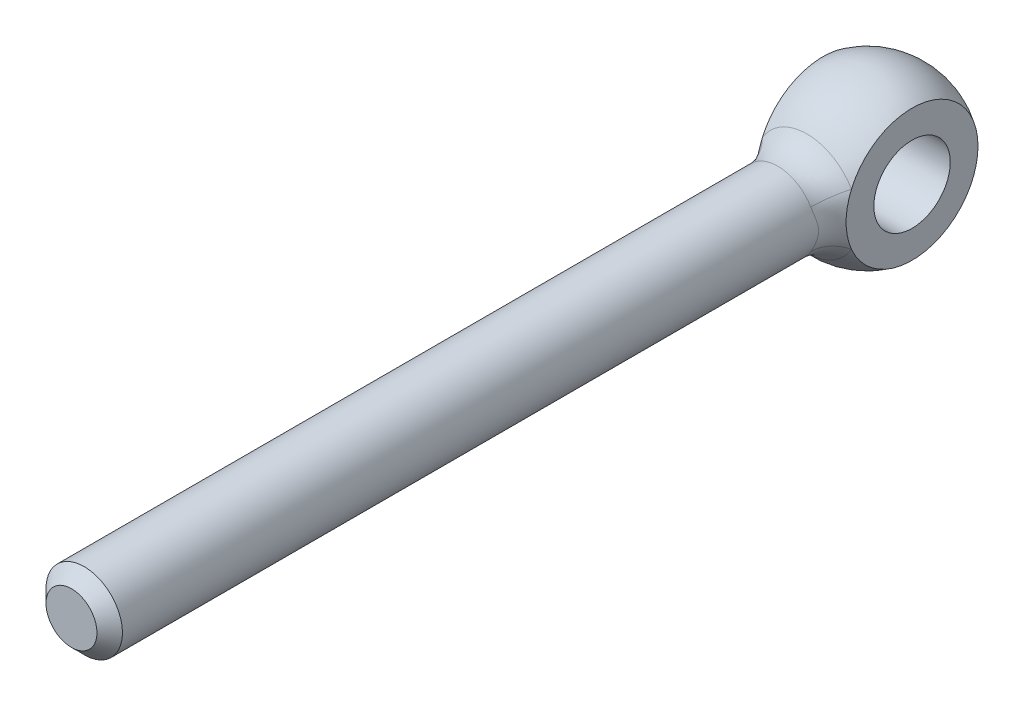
ISO-10303-21;
HEADER;
FILE_DESCRIPTION(('STEP AP214'),'2;1');
FILE_NAME('part.step','',(''),(''),'','','');
FILE_SCHEMA(('AUTOMOTIVE_DESIGN { 1 0 10303 214 1 1 1 1 }'));
ENDSEC;
DATA;
#1=APPLICATION_CONTEXT('core data for automotive mechanical design processes');
#2=APPLICATION_PROTOCOL_DEFINITION('international standard','automotive_design',2000,#1);
#3=PRODUCT_CONTEXT('',#1,'mechanical');
#4=PRODUCT('Part','Part','',(#3));
#5=PRODUCT_RELATED_PRODUCT_CATEGORY('part','',(#4));
#6=PRODUCT_DEFINITION_FORMATION('','',#4);
#7=PRODUCT_DEFINITION_CONTEXT('part definition',#1,'design');
#8=PRODUCT_DEFINITION('design','',#6,#7);
#9=PRODUCT_DEFINITION_SHAPE('','',#8);
#10=(LENGTH_UNIT() NAMED_UNIT(*) SI_UNIT(.MILLI.,.METRE.));
#11=(NAMED_UNIT(*) PLANE_ANGLE_UNIT() SI_UNIT($,.RADIAN.));
#12=(NAMED_UNIT(*) SI_UNIT($,.STERADIAN.) SOLID_ANGLE_UNIT());
#13=UNCERTAINTY_MEASURE_WITH_UNIT(LENGTH_MEASURE(1.E-05),#10,'distance_accuracy_value','');
#14=(GEOMETRIC_REPRESENTATION_CONTEXT(3) GLOBAL_UNCERTAINTY_ASSIGNED_CONTEXT((#13)) GLOBAL_UNIT_ASSIGNED_CONTEXT((#10,
#11,#12)) REPRESENTATION_CONTEXT('',''));
#15=CARTESIAN_POINT('',(0.,0.,0.));
#16=DIRECTION('',(0.,0.,1.));
#17=DIRECTION('',(1.,0.,0.));
#18=AXIS2_PLACEMENT_3D('',#15,#16,#17);
#19=CARTESIAN_POINT('',(0.,0.,0.));
#20=DIRECTION('',(1.,0.,0.));
#21=DIRECTION('',(0.,0.,-1.));
#22=AXIS2_PLACEMENT_3D('',#19,#20,#21);
#23=SPHERICAL_SURFACE('',#22,12.5);
#24=CARTESIAN_POINT('',(-7.,0.,0.));
#25=DIRECTION('',(-1.,0.,0.));
#26=DIRECTION('',(0.,0.,1.));
#27=AXIS2_PLACEMENT_3D('',#24,#25,#26);
#28=CIRCLE('',#27,10.356157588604);
#29=CARTESIAN_POINT('',(-7.,-4.09162768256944,9.51359989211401));
#30=VERTEX_POINT('',#29);
#31=CARTESIAN_POINT('',(-7.,4.09162768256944,9.51359989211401));
#32=VERTEX_POINT('',#31);
#33=EDGE_CURVE('E65',#30,#32,#28,.F.);
#34=ORIENTED_EDGE('',*,*,#33,.T.);
#35=CARTESIAN_POINT('',(0.,0.,9.51359989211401));
#36=DIRECTION('',(0.,0.,-1.));
#37=DIRECTION('',(-1.,0.,0.));
#38=AXIS2_PLACEMENT_3D('',#35,#36,#37);
#39=CIRCLE('',#38,8.10810810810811);
#40=CARTESIAN_POINT('',(7.,4.09162768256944,9.51359989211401));
#41=VERTEX_POINT('',#40);
#42=EDGE_CURVE('E73',#32,#41,#39,.T.);
#43=ORIENTED_EDGE('',*,*,#42,.T.);
#44=CARTESIAN_POINT('',(7.,0.,0.));
#45=DIRECTION('',(-1.,0.,0.));
#46=DIRECTION('',(0.,0.,1.));
#47=AXIS2_PLACEMENT_3D('',#44,#45,#46);
#48=CIRCLE('',#47,10.356157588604);
#49=CARTESIAN_POINT('',(7.,-4.09162768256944,9.51359989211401));
#50=VERTEX_POINT('',#49);
#51=EDGE_CURVE('E61',#50,#41,#48,.F.);
#52=ORIENTED_EDGE('',*,*,#51,.F.);
#53=CARTESIAN_POINT('',(0.,0.,9.51359989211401));
#54=DIRECTION('',(0.,0.,-1.));
#55=DIRECTION('',(-1.,0.,0.));
#56=AXIS2_PLACEMENT_3D('',#53,#54,#55);
#57=CIRCLE('',#56,8.10810810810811);
#58=EDGE_CURVE('E70',#50,#30,#57,.T.);
#59=ORIENTED_EDGE('',*,*,#58,.T.);
#60=EDGE_LOOP('',(#34,#43,#52,#59));
#61=FACE_BOUND('',#60,.T.);
#62=ADVANCED_FACE('F14',(#61),#23,.T.);
#63=CARTESIAN_POINT('',(0.,0.,-10.));
#64=DIRECTION('',(0.,0.,-1.));
#65=DIRECTION('',(-1.,0.,0.));
#66=AXIS2_PLACEMENT_3D('',#63,#64,#65);
#67=CYLINDRICAL_SURFACE('',#66,6.);
#68=CARTESIAN_POINT('',(-7.,-5.52065402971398,8.76198488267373));
#69=CARTESIAN_POINT('',(-4.73347626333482,-3.77093453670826,10.4723797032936));
#70=CARTESIAN_POINT('',(-4.16393928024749,-4.31990852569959,13.7124960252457));
#71=CARTESIAN_POINT('',(-7.,-5.43196771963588,8.81784503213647));
#72=CARTESIAN_POINT('',(-4.75237008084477,-3.73175735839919,10.5424849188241));
#73=CARTESIAN_POINT('',(-4.24629318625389,-4.24055975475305,13.7683625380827));
#74=CARTESIAN_POINT('',(-7.,-5.34113251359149,8.87321411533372));
#75=CARTESIAN_POINT('',(-4.77436164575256,-3.69082707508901,10.6107881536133));
#76=CARTESIAN_POINT('',(-4.32694937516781,-4.15824402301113,13.8171854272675));
#77=CARTESIAN_POINT('',(-7.,-5.15454022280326,8.98290118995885));
#78=CARTESIAN_POINT('',(-4.82415359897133,-3.60403478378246,10.7430059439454));
#79=CARTESIAN_POINT('',(-4.48416075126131,-3.98818699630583,13.901592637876));
#80=CARTESIAN_POINT('',(-7.,-5.05878355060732,9.03721926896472));
#81=CARTESIAN_POINT('',(-4.85191265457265,-3.55821882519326,10.8069099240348));
#82=CARTESIAN_POINT('',(-4.56071628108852,-3.900446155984,13.9371780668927));
#83=CARTESIAN_POINT('',(-7.,-4.86225075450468,9.14444949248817));
#84=CARTESIAN_POINT('',(-4.91269251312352,-3.4604371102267,10.9295511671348));
#85=CARTESIAN_POINT('',(-4.70862752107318,-3.72052921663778,13.9958066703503));
#86=CARTESIAN_POINT('',(-7.,-4.76150508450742,9.19736771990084));
#87=CARTESIAN_POINT('',(-4.94564175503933,-3.40856162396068,10.9883134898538));
#88=CARTESIAN_POINT('',(-4.78000947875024,-3.62838012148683,14.0189176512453));
#89=CARTESIAN_POINT('',(-7.,-4.55392848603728,9.3018943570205));
#90=CARTESIAN_POINT('',(-5.0160308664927,-3.29716736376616,11.1005263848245));
#91=CARTESIAN_POINT('',(-4.91748494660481,-3.43975979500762,14.05392978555));
#92=CARTESIAN_POINT('',(-7.,-4.44710008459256,9.35350329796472));
#93=CARTESIAN_POINT('',(-5.05343304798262,-3.23771146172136,11.1539919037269));
#94=CARTESIAN_POINT('',(-4.98358062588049,-3.34329036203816,14.0658355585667));
#95=CARTESIAN_POINT('',(-7.,-4.29695862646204,9.42274283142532));
#96=CARTESIAN_POINT('',(-5.10676472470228,-3.15059746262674,11.2230561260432));
#97=CARTESIAN_POINT('',(-5.06977684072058,-3.20923152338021,14.0752452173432));
#98=CARTESIAN_POINT('',(-7.,-4.25653508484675,9.44107582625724));
#99=CARTESIAN_POINT('',(-5.12115703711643,-3.12687435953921,11.2410365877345));
#100=CARTESIAN_POINT('',(-5.09235610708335,-3.17328084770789,14.0770920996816));
#101=CARTESIAN_POINT('',(-7.,-4.17477524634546,9.47751307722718));
#102=CARTESIAN_POINT('',(-5.15031007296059,-3.07824781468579,11.2762248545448));
#103=CARTESIAN_POINT('',(-5.13675282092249,-3.10089882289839,14.0795339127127));
#104=CARTESIAN_POINT('',(-7.,-4.13343888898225,9.49561731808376));
#105=CARTESIAN_POINT('',(-5.16506981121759,-3.05334717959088,11.2934339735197));
#106=CARTESIAN_POINT('',(-5.15857021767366,-3.06446744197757,14.0801287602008));
#107=CARTESIAN_POINT('',(-7.,-3.93727090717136,9.57998716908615));
#108=CARTESIAN_POINT('',(-5.2348438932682,-2.93397708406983,11.3720989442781));
#109=CARTESIAN_POINT('',(-5.2591135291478,-2.89245379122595,14.0801244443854));
#110=CARTESIAN_POINT('',(-7.,-3.77644238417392,9.64471624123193));
#111=CARTESIAN_POINT('',(-5.2919851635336,-2.83149056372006,11.4288485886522));
#112=CARTESIAN_POINT('',(-5.33294423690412,-2.75394693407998,14.0720012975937));
#113=CARTESIAN_POINT('',(-7.,-3.44057965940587,9.76957212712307));
#114=CARTESIAN_POINT('',(-5.4067438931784,-2.60847852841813,11.5309624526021));
#115=CARTESIAN_POINT('',(-5.46944812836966,-2.47178930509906,14.0431824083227));
#116=CARTESIAN_POINT('',(-7.,-3.26553398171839,9.82969514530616));
#117=CARTESIAN_POINT('',(-5.46437197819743,-2.48805001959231,11.5764173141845));
#118=CARTESIAN_POINT('',(-5.53211216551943,-2.32813443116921,14.0224764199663));
#119=CARTESIAN_POINT('',(-7.,-2.89956860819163,9.94381011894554));
#120=CARTESIAN_POINT('',(-5.57626625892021,-2.22857345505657,11.6561394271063));
#121=CARTESIAN_POINT('',(-5.64613166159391,-2.03613701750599,13.9728223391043));
#122=CARTESIAN_POINT('',(-7.,-2.70859175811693,9.99777819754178));
#123=CARTESIAN_POINT('',(-5.63058064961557,-2.08950571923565,11.6904716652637));
#124=CARTESIAN_POINT('',(-5.69744376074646,-1.88777889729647,13.9438435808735));
#125=CARTESIAN_POINT('',(-7.,-2.31090588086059,10.0971127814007));
#126=CARTESIAN_POINT('',(-5.73158522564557,-1.79407236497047,11.748506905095));
#127=CARTESIAN_POINT('',(-5.78825827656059,-1.58765614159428,13.8830399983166));
#128=CARTESIAN_POINT('',(-7.,-2.10419766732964,10.142479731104));
#129=CARTESIAN_POINT('',(-5.77837504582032,-1.63766816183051,11.7723070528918));
#130=CARTESIAN_POINT('',(-5.82776130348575,-1.43589168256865,13.8512153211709));
#131=CARTESIAN_POINT('',(-7.,-1.6708535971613,10.222907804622));
#132=CARTESIAN_POINT('',(-5.86150775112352,-1.3060060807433,11.8111628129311));
#133=CARTESIAN_POINT('',(-5.8955793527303,-1.12600155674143,13.7902383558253));
#134=CARTESIAN_POINT('',(-7.,-1.44386631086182,10.257704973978));
#135=CARTESIAN_POINT('',(-5.89771030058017,-1.13021047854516,11.8260828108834));
#136=CARTESIAN_POINT('',(-5.92361308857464,-0.967810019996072,13.7611653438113));
#137=CARTESIAN_POINT('',(-7.,-0.977611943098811,10.3125756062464));
#138=CARTESIAN_POINT('',(-5.95469562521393,-0.767202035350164,11.8481867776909));
#139=CARTESIAN_POINT('',(-5.96692621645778,-0.649309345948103,13.7134560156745));
#140=CARTESIAN_POINT('',(-7.,-0.738348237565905,10.3326530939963));
#141=CARTESIAN_POINT('',(-5.97558995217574,-0.579692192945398,11.8554206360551));
#142=CARTESIAN_POINT('',(-5.98220909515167,-0.489000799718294,13.6948168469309));
#143=CARTESIAN_POINT('',(-7.,-0.254575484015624,10.3558486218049));
#144=CARTESIAN_POINT('',(-5.99967335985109,-0.200191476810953,11.8636655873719));
#145=CARTESIAN_POINT('',(-5.99980579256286,-0.167748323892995,13.6731565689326));
#146=CARTESIAN_POINT('',(-7.,-0.0100795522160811,10.3590049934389));
#147=CARTESIAN_POINT('',(-6.00295430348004,-0.0078120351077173,11.8647087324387));
#148=CARTESIAN_POINT('',(-6.00214892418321,-0.00680665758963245,13.6701001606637));
#149=CARTESIAN_POINT('',(-7.,0.476166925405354,10.3480653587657));
#150=CARTESIAN_POINT('',(-5.99159819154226,0.374022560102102,11.8609024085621));
#151=CARTESIAN_POINT('',(-5.99390260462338,0.314617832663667,13.6804268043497));
#152=CARTESIAN_POINT('',(-7.,0.717917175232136,10.3339675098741));
#153=CARTESIAN_POINT('',(-5.97693421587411,0.563895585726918,11.8560440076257));
#154=CARTESIAN_POINT('',(-5.98331177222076,0.475100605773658,13.6938116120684));
#155=CARTESIAN_POINT('',(-7.,1.17711091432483,10.2914790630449));
#156=CARTESIAN_POINT('',(-5.93280718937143,0.922682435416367,11.8398412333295));
#157=CARTESIAN_POINT('',(-5.95036755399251,0.784814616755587,13.7319958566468));
#158=CARTESIAN_POINT('',(-7.,1.39514584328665,10.2639850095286));
#159=CARTESIAN_POINT('',(-5.90419169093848,1.09249310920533,11.8288660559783));
#160=CARTESIAN_POINT('',(-5.92874844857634,0.934149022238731,13.7560718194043));
#161=CARTESIAN_POINT('',(-7.,1.81839647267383,10.1975189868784));
#162=CARTESIAN_POINT('',(-5.83527764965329,1.419266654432,11.7992510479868));
#163=CARTESIAN_POINT('',(-5.87439634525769,1.23051561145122,13.8099532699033));
#164=CARTESIAN_POINT('',(-7.,2.02361108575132,10.1585460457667));
#165=CARTESIAN_POINT('',(-5.79487748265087,1.57641327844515,11.7805559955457));
#166=CARTESIAN_POINT('',(-5.84166240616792,1.37754759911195,13.8397592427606));
#167=CARTESIAN_POINT('',(-7.,2.41979553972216,10.0715339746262));
#168=CARTESIAN_POINT('',(-5.70553324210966,1.87549175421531,11.7340817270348));
#169=CARTESIAN_POINT('',(-5.76521762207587,1.66881679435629,13.8994060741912));
#170=CARTESIAN_POINT('',(-7.,2.61075717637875,10.0234896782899));
#171=CARTESIAN_POINT('',(-5.65648641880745,2.01749587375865,11.7062202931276));
#172=CARTESIAN_POINT('',(-5.7215005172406,1.81305235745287,13.9292469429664));
#173=CARTESIAN_POINT('',(-7.,2.97823759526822,9.92051035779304));
#174=CARTESIAN_POINT('',(-5.55330052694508,2.2849738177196,11.6404397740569));
#175=CARTESIAN_POINT('',(-5.62324851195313,2.09804332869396,13.9837841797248));
#176=CARTESIAN_POINT('',(-7.,3.1547579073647,9.86557606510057));
#177=CARTESIAN_POINT('',(-5.49908883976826,2.41044201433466,11.6024299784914));
#178=CARTESIAN_POINT('',(-5.56871475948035,2.23879910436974,14.0084810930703));
#179=CARTESIAN_POINT('',(-7.,3.4776573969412,9.75613046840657));
#180=CARTESIAN_POINT('',(-5.39445517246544,2.63320590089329,11.5201628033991));
#181=CARTESIAN_POINT('',(-5.45483407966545,2.50267587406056,14.0464316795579));
#182=CARTESIAN_POINT('',(-7.,3.62530052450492,9.70209213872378));
#183=CARTESIAN_POINT('',(-5.34411434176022,2.73206566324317,11.4767663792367));
#184=CARTESIAN_POINT('',(-5.39646281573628,2.62618577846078,14.0605611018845));
#185=CARTESIAN_POINT('',(-7.,3.9101338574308,9.59083995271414));
#186=CARTESIAN_POINT('',(-5.24470174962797,2.91650977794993,11.3815427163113));
#187=CARTESIAN_POINT('',(-5.27135185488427,2.86906036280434,14.0783371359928));
#188=CARTESIAN_POINT('',(-7.,4.04732718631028,9.53362705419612));
#189=CARTESIAN_POINT('',(-5.19563379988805,3.00201545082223,11.3296558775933));
#190=CARTESIAN_POINT('',(-5.2046146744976,2.98842627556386,14.0819868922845));
#191=CARTESIAN_POINT('',(-7.,4.31290967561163,9.41647692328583));
#192=CARTESIAN_POINT('',(-5.10089049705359,3.16117080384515,11.217554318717));
#193=CARTESIAN_POINT('',(-5.0627722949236,3.22291536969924,14.0764425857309));
#194=CARTESIAN_POINT('',(-7.,4.4412469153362,9.35652657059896));
#195=CARTESIAN_POINT('',(-5.05526955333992,3.23465246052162,11.1572503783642));
#196=CARTESIAN_POINT('',(-4.98762357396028,3.33801195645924,14.0671785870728));
#197=CARTESIAN_POINT('',(-7.,4.6894021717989,9.23463387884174));
#198=CARTESIAN_POINT('',(-4.96955301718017,3.37092279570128,11.029119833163));
#199=CARTESIAN_POINT('',(-4.82981665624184,3.56255813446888,14.0336945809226));
#200=CARTESIAN_POINT('',(-7.,4.80920993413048,9.17268926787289));
#201=CARTESIAN_POINT('',(-4.92951762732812,3.43360058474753,10.9612577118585));
#202=CARTESIAN_POINT('',(-4.74714968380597,3.67200088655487,14.0094568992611));
#203=CARTESIAN_POINT('',(-7.,4.9251572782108,9.11003983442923));
#204=CARTESIAN_POINT('',(-4.8933961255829,3.49152887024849,10.8902848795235));
#205=CARTESIAN_POINT('',(-4.66109414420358,3.77812140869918,13.9767461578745));
#206=(BOUNDED_SURFACE() B_SPLINE_SURFACE(3,2,((#68,#69,#70),(#71,#72,#73),(#74,#75,#76),(#77,
#78,#79),(#80,#81,#82),(#83,#84,#85),(#86,#87,#88),(#89,#90,#91),(#92,#93,#94),(#95,#96,#97),
(#98,#99,#100),(#101,#102,#103),(#104,#105,#106),(#107,#108,#109),(#110,#111,#112),(#113,#114,
#115),(#116,#117,#118),(#119,#120,#121),(#122,#123,#124),(#125,#126,#127),(#128,#129,#130),
(#131,#132,#133),(#134,#135,#136),(#137,#138,#139),(#140,#141,#142),(#143,#144,#145),(#146,#147,
#148),(#149,#150,#151),(#152,#153,#154),(#155,#156,#157),(#158,#159,#160),(#161,#162,#163),
(#164,#165,#166),(#167,#168,#169),(#170,#171,#172),(#173,#174,#175),(#176,#177,#178),(#179,#180,
#181),(#182,#183,#184),(#185,#186,#187),(#188,#189,#190),(#191,#192,#193),(#194,#195,#196),
(#197,#198,#199),(#200,#201,#202),(#203,#204,#205)),.UNSPECIFIED.,.F.,.F.,
.F.) B_SPLINE_SURFACE_WITH_KNOTS((4,2,2,2,2,2,2,2,2,2,2,2,2,2,2,2,2,2,2,2,2,2,4),(3,3),(0.,
0.706069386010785,1.41207968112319,2.11421270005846,2.81605612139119,3.07081429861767,
3.32558940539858,4.26615695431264,5.20749141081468,6.15236157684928,7.097182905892,
8.06395765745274,9.03046796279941,9.99478789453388,10.9592108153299,11.8664791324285,
12.7738242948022,13.6816877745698,14.5894549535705,15.4094238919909,16.2291467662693,
17.0533262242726,17.8784803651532),(0.,1.),
.UNSPECIFIED.) GEOMETRIC_REPRESENTATION_ITEM() RATIONAL_B_SPLINE_SURFACE(((1.,0.874036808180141,
1.),(1.,0.875980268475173,1.),(1.,0.878049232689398,1.),(1.,0.882404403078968,1.),(1.,
0.884690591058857,1.),(1.,0.889433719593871,1.),(1.,0.891889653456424,1.),(1.,0.896934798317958,
1.),(1.,0.899523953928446,1.),(1.,0.90310513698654,1.),(1.,0.904063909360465,1.),(1.,
0.905988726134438,1.),(1.,0.906954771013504,1.),(1.,0.911497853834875,1.),(1.,0.915103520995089,
1.),(1.,0.922211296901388,1.),(1.,0.925713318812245,1.),(1.,0.932445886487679,1.),(1.,
0.93567536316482,1.),(1.,0.941657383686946,1.),(1.,0.944409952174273,1.),(1.,0.949300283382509,
1.),(1.,0.951422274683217,1.),(1.,0.954768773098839,1.),(1.,0.955993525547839,1.),(1.,
0.95740836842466,1.),(1.,0.957600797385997,1.),(1.,0.956933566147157,1.),(1.,0.956073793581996,
1.),(1.,0.953481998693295,1.),(1.,0.95180468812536,1.),(1.,0.947755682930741,1.),(1.,
0.945383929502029,1.),(1.,0.94011425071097,1.),(1.,0.937216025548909,1.),(1.,0.931066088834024,
1.),(1.,0.927814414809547,1.),(1.,0.921446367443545,1.),(1.,0.918347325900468,1.),(1.,
0.91211075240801,1.),(1.,0.908973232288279,1.),(1.,0.902748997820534,1.),(1.,0.899662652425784,
1.),(1.,0.893647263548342,1.),(1.,0.890718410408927,1.),(1.,0.887916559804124,1.))) REPRESENTATION_ITEM('') SURFACE());
#207=CARTESIAN_POINT('',(-4.66109414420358,3.77812140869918,13.9767461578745));
#208=CARTESIAN_POINT('',(-4.74714968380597,3.67200088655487,14.0094568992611));
#209=CARTESIAN_POINT('',(-4.82981665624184,3.56255813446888,14.0336945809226));
#210=CARTESIAN_POINT('',(-4.98762357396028,3.33801195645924,14.0671785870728));
#211=CARTESIAN_POINT('',(-5.0627722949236,3.22291536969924,14.0764425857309));
#212=CARTESIAN_POINT('',(-5.2046146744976,2.98842627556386,14.0819868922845));
#213=CARTESIAN_POINT('',(-5.27135185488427,2.86906036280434,14.0783371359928));
#214=CARTESIAN_POINT('',(-5.39646281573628,2.62618577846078,14.0605611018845));
#215=CARTESIAN_POINT('',(-5.45483407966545,2.50267587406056,14.0464316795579));
#216=CARTESIAN_POINT('',(-5.56871475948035,2.23879910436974,14.0084810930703));
#217=CARTESIAN_POINT('',(-5.62324851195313,2.09804332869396,13.9837841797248));
#218=CARTESIAN_POINT('',(-5.7215005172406,1.81305235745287,13.9292469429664));
#219=CARTESIAN_POINT('',(-5.76521762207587,1.66881679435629,13.8994060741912));
#220=CARTESIAN_POINT('',(-5.84166240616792,1.37754759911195,13.8397592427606));
#221=CARTESIAN_POINT('',(-5.87439634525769,1.23051561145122,13.8099532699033));
#222=CARTESIAN_POINT('',(-5.92874844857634,0.934149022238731,13.7560718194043));
#223=CARTESIAN_POINT('',(-5.95036755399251,0.784814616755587,13.7319958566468));
#224=CARTESIAN_POINT('',(-5.98331177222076,0.475100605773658,13.6938116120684));
#225=CARTESIAN_POINT('',(-5.99390260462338,0.314617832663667,13.6804268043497));
#226=CARTESIAN_POINT('',(-6.00214892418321,-0.00680665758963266,13.6701001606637));
#227=CARTESIAN_POINT('',(-5.99980579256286,-0.167748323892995,13.6731565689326));
#228=CARTESIAN_POINT('',(-5.98220909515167,-0.489000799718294,13.6948168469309));
#229=CARTESIAN_POINT('',(-5.96692621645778,-0.649309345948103,13.7134560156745));
#230=CARTESIAN_POINT('',(-5.92361308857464,-0.967810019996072,13.7611653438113));
#231=CARTESIAN_POINT('',(-5.8955793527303,-1.12600155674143,13.7902383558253));
#232=CARTESIAN_POINT('',(-5.82776130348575,-1.43589168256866,13.8512153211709));
#233=CARTESIAN_POINT('',(-5.78825827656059,-1.58765614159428,13.8830399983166));
#234=CARTESIAN_POINT('',(-5.69744376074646,-1.88777889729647,13.9438435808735));
#235=CARTESIAN_POINT('',(-5.64613166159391,-2.03613701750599,13.9728223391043));
#236=CARTESIAN_POINT('',(-5.53211216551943,-2.32813443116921,14.0224764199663));
#237=CARTESIAN_POINT('',(-5.46944812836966,-2.47178930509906,14.0431824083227));
#238=CARTESIAN_POINT('',(-5.33294423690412,-2.75394693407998,14.0720012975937));
#239=CARTESIAN_POINT('',(-5.2591135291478,-2.89245379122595,14.0801244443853));
#240=CARTESIAN_POINT('',(-5.15857021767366,-3.06446744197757,14.0801287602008));
#241=CARTESIAN_POINT('',(-5.13675282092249,-3.10089882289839,14.0795339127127));
#242=CARTESIAN_POINT('',(-5.09235610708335,-3.17328084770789,14.0770920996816));
#243=CARTESIAN_POINT('',(-5.06977684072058,-3.20923152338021,14.0752452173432));
#244=CARTESIAN_POINT('',(-4.98358062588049,-3.34329036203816,14.0658355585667));
#245=CARTESIAN_POINT('',(-4.91748494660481,-3.43975979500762,14.05392978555));
#246=CARTESIAN_POINT('',(-4.78000947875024,-3.62838012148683,14.0189176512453));
#247=CARTESIAN_POINT('',(-4.70862752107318,-3.72052921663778,13.9958066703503));
#248=CARTESIAN_POINT('',(-4.56071628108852,-3.900446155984,13.9371780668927));
#249=CARTESIAN_POINT('',(-4.48416075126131,-3.98818699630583,13.901592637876));
#250=CARTESIAN_POINT('',(-4.32694937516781,-4.15824402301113,13.8171854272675));
#251=CARTESIAN_POINT('',(-4.24629318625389,-4.24055975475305,13.7683625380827));
#252=CARTESIAN_POINT('',(-4.16393928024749,-4.31990852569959,13.7124960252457));
#253=B_SPLINE_CURVE_WITH_KNOTS('',3,(#207,#208,#209,#210,#211,#212,#213,#214,#215,#216,#217,
#218,#219,#220,#221,#222,#223,#224,#225,#226,#227,#228,#229,#230,#231,#232,#233,#234,#235,#236,
#237,#238,#239,#240,#241,#242,#243,#244,#245,#246,#247,#248,#249,#250,#251,#252),.UNSPECIFIED.,
.F.,.F.,(4,2,2,2,2,2,2,2,2,2,2,2,2,2,2,2,2,2,2,2,2,2,4),(0.,0.825154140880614,1.64933359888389,
2.4690564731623,3.28902541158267,4.1967925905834,5.10465607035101,6.01200123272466,
6.9192695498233,7.88369247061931,8.84801240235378,9.81452270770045,10.7812974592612,
11.7261187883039,12.6709889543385,13.6123234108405,14.5528909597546,14.8076660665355,
15.062424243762,15.7642676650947,16.46640068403,17.1724109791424,17.8784803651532),.UNSPECIFIED.);
#254=CARTESIAN_POINT('',(-5.18,3.02780448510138,14.0801278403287));
#255=VERTEX_POINT('',#254);
#256=CARTESIAN_POINT('',(-5.18,-3.02780448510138,14.0801278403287));
#257=VERTEX_POINT('',#256);
#258=EDGE_CURVE('E88',#255,#257,#253,.T.);
#259=ORIENTED_EDGE('',*,*,#258,.T.);
#260=CARTESIAN_POINT('',(0.,0.,14.0801278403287));
#261=DIRECTION('',(0.,0.,-1.));
#262=DIRECTION('',(-1.,0.,0.));
#263=AXIS2_PLACEMENT_3D('',#260,#261,#262);
#264=CIRCLE('',#263,6.);
#265=CARTESIAN_POINT('',(5.18,-3.02780448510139,14.0801278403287));
#266=VERTEX_POINT('',#265);
#267=EDGE_CURVE('E9',#257,#266,#264,.F.);
#268=ORIENTED_EDGE('',*,*,#267,.T.);
#269=CARTESIAN_POINT('',(7.,5.52065409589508,8.76198484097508));
#270=CARTESIAN_POINT('',(4.73347624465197,3.77093455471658,10.4723796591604));
#271=CARTESIAN_POINT('',(4.16393928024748,4.3199085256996,13.7124960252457));
#272=CARTESIAN_POINT('',(7.,5.43196774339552,8.81784501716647));
#273=CARTESIAN_POINT('',(4.75237007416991,3.73175736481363,10.5424849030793));
#274=CARTESIAN_POINT('',(4.24629318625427,4.24055975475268,13.768362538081));
#275=CARTESIAN_POINT('',(7.,5.34113251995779,8.87321411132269));
#276=CARTESIAN_POINT('',(4.77436164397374,3.69082707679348,10.6107881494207));
#277=CARTESIAN_POINT('',(4.32694937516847,4.15824402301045,13.8171854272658));
#278=CARTESIAN_POINT('',(7.,5.15454021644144,8.98290119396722));
#279=CARTESIAN_POINT('',(4.82415360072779,3.60403478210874,10.74300594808));
#280=CARTESIAN_POINT('',(4.48416075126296,3.988186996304,13.9015926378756));
#281=CARTESIAN_POINT('',(7.,5.05878354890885,9.03721927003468));
#282=CARTESIAN_POINT('',(4.85191265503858,3.55821882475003,10.8069099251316));
#283=CARTESIAN_POINT('',(4.56071628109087,3.90044615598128,13.9371780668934));
#284=CARTESIAN_POINT('',(7.,4.8622507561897,9.14444949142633));
#285=CARTESIAN_POINT('',(4.91269251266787,3.46043711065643,10.9295511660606));
#286=CARTESIAN_POINT('',(4.70862752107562,3.72052921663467,13.9958066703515));
#287=CARTESIAN_POINT('',(7.,4.76150508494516,9.19736771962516));
#288=CARTESIAN_POINT('',(4.94564175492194,3.40856162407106,10.9883134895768));
#289=CARTESIAN_POINT('',(4.78000947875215,3.62838012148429,14.018917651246));
#290=CARTESIAN_POINT('',(7.,4.55392848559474,9.30189435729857));
#291=CARTESIAN_POINT('',(5.01603086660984,3.29716736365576,11.1005263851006));
#292=CARTESIAN_POINT('',(4.91748494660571,3.4397597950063,14.0539297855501));
#293=CARTESIAN_POINT('',(7.,4.44710008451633,9.35350329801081));
#294=CARTESIAN_POINT('',(5.05343304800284,3.23771146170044,11.1539919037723));
#295=CARTESIAN_POINT('',(4.98358062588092,3.34329036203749,14.0658355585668));
#296=CARTESIAN_POINT('',(7.,4.2969586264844,9.42274283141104));
#297=CARTESIAN_POINT('',(5.1067647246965,3.15059746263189,11.2230561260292));
#298=CARTESIAN_POINT('',(5.06977684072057,3.20923152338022,14.0752452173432));
#299=CARTESIAN_POINT('',(7.,4.25653508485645,9.44107582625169));
#300=CARTESIAN_POINT('',(5.12115703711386,3.12687435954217,11.2410365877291));
#301=CARTESIAN_POINT('',(5.09235610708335,3.1732808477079,14.0770920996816));
#302=CARTESIAN_POINT('',(7.,4.17477524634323,9.4775130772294));
#303=CARTESIAN_POINT('',(5.15031007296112,3.07824781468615,11.276224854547));
#304=CARTESIAN_POINT('',(5.13675282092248,3.1008988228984,14.0795339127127));
#305=CARTESIAN_POINT('',(7.,4.13343888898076,9.49561731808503));
#306=CARTESIAN_POINT('',(5.16506981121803,3.05334717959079,11.2934339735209));
#307=CARTESIAN_POINT('',(5.15857021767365,3.06446744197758,14.0801287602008));
#308=CARTESIAN_POINT('',(7.,3.93727090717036,9.57998716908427));
#309=CARTESIAN_POINT('',(5.2348438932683,2.93397708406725,11.3720989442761));
#310=CARTESIAN_POINT('',(5.2591135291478,2.89245379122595,14.0801244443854));
#311=CARTESIAN_POINT('',(7.,3.77644238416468,9.64471624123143));
#312=CARTESIAN_POINT('',(5.29198516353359,2.83149056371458,11.4288485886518));
#313=CARTESIAN_POINT('',(5.33294423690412,2.75394693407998,14.0720012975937));
#314=CARTESIAN_POINT('',(7.,3.44057965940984,9.76957212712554));
#315=CARTESIAN_POINT('',(5.40674389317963,2.60847852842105,11.5309624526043));
#316=CARTESIAN_POINT('',(5.46944812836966,2.47178930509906,14.0431824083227));
#317=CARTESIAN_POINT('',(7.,3.26553398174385,9.82969514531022));
#318=CARTESIAN_POINT('',(5.46437197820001,2.48805001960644,11.5764173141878));
#319=CARTESIAN_POINT('',(5.53211216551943,2.32813443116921,14.0224764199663));
#320=CARTESIAN_POINT('',(7.,2.89956860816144,9.94381011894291));
#321=CARTESIAN_POINT('',(5.57626625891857,2.22857345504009,11.6561394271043));
#322=CARTESIAN_POINT('',(5.64613166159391,2.03613701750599,13.9728223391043));
#323=CARTESIAN_POINT('',(7.,2.70859175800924,9.99777819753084));
#324=CARTESIAN_POINT('',(5.63058064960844,2.08950571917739,11.6904716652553));
#325=CARTESIAN_POINT('',(5.69744376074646,1.88777889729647,13.9438435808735));
#326=CARTESIAN_POINT('',(7.,2.31090588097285,10.0971127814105));
#327=CARTESIAN_POINT('',(5.73158522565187,1.79407236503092,11.7485069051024));
#328=CARTESIAN_POINT('',(5.78825827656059,1.58765614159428,13.8830399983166));
#329=CARTESIAN_POINT('',(7.,2.10419766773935,10.1424797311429));
#330=CARTESIAN_POINT('',(5.77837504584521,1.63766816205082,11.7723070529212));
#331=CARTESIAN_POINT('',(5.82776130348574,1.43589168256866,13.8512153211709));
#332=CARTESIAN_POINT('',(7.,1.67085359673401,10.2229078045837));
#333=CARTESIAN_POINT('',(5.8615077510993,1.30600608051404,11.8111628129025));
#334=CARTESIAN_POINT('',(5.8955793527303,1.12600155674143,13.7902383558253));
#335=CARTESIAN_POINT('',(7.,1.44386630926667,10.2577049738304));
#336=CARTESIAN_POINT('',(5.89771030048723,1.13021047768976,11.8260828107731));
#337=CARTESIAN_POINT('',(5.92361308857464,0.967810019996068,13.7611653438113));
#338=CARTESIAN_POINT('',(7.,0.977611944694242,10.3125756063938));
#339=CARTESIAN_POINT('',(5.95469562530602,0.767202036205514,11.8481867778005));
#340=CARTESIAN_POINT('',(5.96692621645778,0.649309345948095,13.7134560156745));
#341=CARTESIAN_POINT('',(7.,0.73834824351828,10.332653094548));
#342=CARTESIAN_POINT('',(5.97558995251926,0.579692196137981,11.8554206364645));
#343=CARTESIAN_POINT('',(5.98220909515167,0.489000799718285,13.6948168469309));
#344=CARTESIAN_POINT('',(7.,0.254575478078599,10.3558486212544));
#345=CARTESIAN_POINT('',(5.99967335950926,0.200191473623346,11.8636655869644));
#346=CARTESIAN_POINT('',(5.99980579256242,0.167748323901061,13.6731565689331));
#347=CARTESIAN_POINT('',(7.,0.0100795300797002,10.3590049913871));
#348=CARTESIAN_POINT('',(6.00295430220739,0.00781202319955,11.8647087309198));
#349=CARTESIAN_POINT('',(6.00214892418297,0.006806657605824,13.670100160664));
#350=CARTESIAN_POINT('',(7.,-0.47616690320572,10.3480653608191));
#351=CARTESIAN_POINT('',(5.99159819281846,-0.374022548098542,11.8609024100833));
#352=CARTESIAN_POINT('',(5.99390260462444,-0.314617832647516,13.6804268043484));
#353=CARTESIAN_POINT('',(7.,-0.717917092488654,10.3339675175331));
#354=CARTESIAN_POINT('',(5.9769342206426,-0.563895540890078,11.8560440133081));
#355=CARTESIAN_POINT('',(5.98331177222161,-0.475100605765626,13.6938116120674));
#356=CARTESIAN_POINT('',(7.,-1.17711083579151,10.2914790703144));
#357=CARTESIAN_POINT('',(5.93280719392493,-0.92268239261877,11.8398412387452));
#358=CARTESIAN_POINT('',(5.95036755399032,-0.784814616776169,13.7319958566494));
#359=CARTESIAN_POINT('',(7.,-1.3951458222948,10.2639850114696));
#360=CARTESIAN_POINT('',(5.90419169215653,-1.09249309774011,11.8288660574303));
#361=CARTESIAN_POINT('',(5.92874844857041,-0.93414902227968,13.7560718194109));
#362=CARTESIAN_POINT('',(7.,-1.81839649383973,10.1975189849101));
#363=CARTESIAN_POINT('',(5.8352776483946,-1.41926666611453,11.7992510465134));
#364=CARTESIAN_POINT('',(5.87439634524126,-1.23051561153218,13.8099532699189));
#365=CARTESIAN_POINT('',(7.,-2.02361109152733,10.1585460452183));
#366=CARTESIAN_POINT('',(5.7948774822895,-1.57641328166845,11.7805559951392));
#367=CARTESIAN_POINT('',(5.84166240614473,-1.37754759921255,13.8397592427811));
#368=CARTESIAN_POINT('',(7.,-2.41979553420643,10.071533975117));
#369=CARTESIAN_POINT('',(5.70553324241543,-1.87549175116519,11.7340817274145));
#370=CARTESIAN_POINT('',(5.76521762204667,-1.66881679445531,13.8994060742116));
#371=CARTESIAN_POINT('',(7.,-2.61075717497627,10.0234896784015));
#372=CARTESIAN_POINT('',(5.65648641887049,-2.01749587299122,11.7062202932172));
#373=CARTESIAN_POINT('',(5.72150051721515,-1.81305235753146,13.929246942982));
#374=CARTESIAN_POINT('',(7.,-2.97823759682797,9.92051035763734));
#375=CARTESIAN_POINT('',(5.5533005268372,-2.28497381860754,11.6404397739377));
#376=CARTESIAN_POINT('',(5.62324851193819,-2.09804332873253,13.9837841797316));
#377=CARTESIAN_POINT('',(7.,-3.15475790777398,9.86557606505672));
#378=CARTESIAN_POINT('',(5.49908883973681,-2.41044201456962,11.6024299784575));
#379=CARTESIAN_POINT('',(5.56871475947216,-2.23879910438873,14.0084810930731));
#380=CARTESIAN_POINT('',(7.,-3.47765739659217,9.75613046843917));
#381=CARTESIAN_POINT('',(5.39445517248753,-2.63320590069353,11.5201628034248));
#382=CARTESIAN_POINT('',(5.45483407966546,-2.50267587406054,14.0464316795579));
#383=CARTESIAN_POINT('',(7.,-3.62530052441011,9.70209213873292));
#384=CARTESIAN_POINT('',(5.34411434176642,-2.73206566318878,11.476766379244));
#385=CARTESIAN_POINT('',(5.39646281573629,-2.62618577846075,14.0605611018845));
#386=CARTESIAN_POINT('',(7.,-3.91013385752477,9.59083995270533));
#387=CARTESIAN_POINT('',(5.24470174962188,-2.91650977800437,11.3815427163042));
#388=CARTESIAN_POINT('',(5.27135185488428,-2.86906036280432,14.0783371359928));
#389=CARTESIAN_POINT('',(7.,-4.04732718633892,9.53362705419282));
#390=CARTESIAN_POINT('',(5.19563379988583,-3.00201545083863,11.3296558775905));
#391=CARTESIAN_POINT('',(5.20461467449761,-2.98842627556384,14.0819868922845));
#392=CARTESIAN_POINT('',(7.,-4.312909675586,9.41647692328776));
#393=CARTESIAN_POINT('',(5.100890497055,-3.16117080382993,11.2175543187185));
#394=CARTESIAN_POINT('',(5.0627722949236,-3.22291536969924,14.0764425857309));
#395=CARTESIAN_POINT('',(7.,-4.44124691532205,9.35652657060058));
#396=CARTESIAN_POINT('',(5.05526955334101,-3.23465246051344,11.1572503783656));
#397=CARTESIAN_POINT('',(4.98762357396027,-3.33801195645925,14.0671785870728));
#398=CARTESIAN_POINT('',(7.,-4.68940217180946,9.23463387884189));
#399=CARTESIAN_POINT('',(4.96955301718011,-3.37092279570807,11.0291198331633));
#400=CARTESIAN_POINT('',(4.82981665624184,-3.56255813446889,14.0336945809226));
#401=CARTESIAN_POINT('',(7.,-4.80920993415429,9.17268926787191));
#402=CARTESIAN_POINT('',(4.92951762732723,-3.43360058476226,10.9612577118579));
#403=CARTESIAN_POINT('',(4.74714968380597,-3.67200088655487,14.0094568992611));
#404=CARTESIAN_POINT('',(7.,-4.9251572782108,9.11003983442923));
#405=CARTESIAN_POINT('',(4.8933961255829,-3.49152887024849,10.8902848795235));
#406=CARTESIAN_POINT('',(4.66109414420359,-3.77812140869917,13.9767461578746));
#407=(BOUNDED_SURFACE() B_SPLINE_SURFACE(3,2,((#269,#270,#271),(#272,#273,#274),(#275,#276,
#277),(#278,#279,#280),(#281,#282,#283),(#284,#285,#286),(#287,#288,#289),(#290,#291,#292),
(#293,#294,#295),(#296,#297,#298),(#299,#300,#301),(#302,#303,#304),(#305,#306,#307),(#308,#309,
#310),(#311,#312,#313),(#314,#315,#316),(#317,#318,#319),(#320,#321,#322),(#323,#324,#325),
(#326,#327,#328),(#329,#330,#331),(#332,#333,#334),(#335,#336,#337),(#338,#339,#340),(#341,#342,
#343),(#344,#345,#346),(#347,#348,#349),(#350,#351,#352),(#353,#354,#355),(#356,#357,#358),
(#359,#360,#361),(#362,#363,#364),(#365,#366,#367),(#368,#369,#370),(#371,#372,#373),(#374,#375,
#376),(#377,#378,#379),(#380,#381,#382),(#383,#384,#385),(#386,#387,#388),(#389,#390,#391),
(#392,#393,#394),(#395,#396,#397),(#398,#399,#400),(#401,#402,#403),(#404,#405,#406)),
.UNSPECIFIED.,.F.,.F.,.F.) B_SPLINE_SURFACE_WITH_KNOTS((4,2,2,2,2,2,2,2,2,2,2,2,2,2,2,2,2,2,2,2,
2,2,4),(3,3),(0.,0.706069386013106,1.41207968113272,2.11421270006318,2.81605612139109,
3.07081429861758,3.3255894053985,4.26615695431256,5.2074914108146,6.1523615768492,
7.09718290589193,8.06395765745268,9.03046796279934,9.99478789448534,10.9592108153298,
11.8664791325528,12.7738242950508,13.6816877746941,14.5894549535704,15.4094238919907,
16.2291467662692,17.0533262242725,17.8784803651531),(0.,1.),
.UNSPECIFIED.) GEOMETRIC_REPRESENTATION_ITEM() RATIONAL_B_SPLINE_SURFACE(((1.,0.874036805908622,
1.),(1.,0.875980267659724,1.),(1.,0.878049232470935,1.),(1.,0.882404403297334,1.),(1.,
0.88469059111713,1.),(1.,0.889433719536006,1.),(1.,0.891889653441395,1.),(1.,0.896934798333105,
1.),(1.,0.899523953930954,1.),(1.,0.903105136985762,1.),(1.,0.904063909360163,1.),(1.,
0.90598872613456,1.),(1.,0.906954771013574,1.),(1.,0.911497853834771,1.),(1.,0.915103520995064,
1.),(1.,0.922211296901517,1.),(1.,0.925713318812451,1.),(1.,0.932445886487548,1.),(1.,
0.935675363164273,1.),(1.,0.941657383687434,1.),(1.,0.944409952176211,1.),(1.,0.949300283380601,
1.),(1.,0.951422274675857,1.),(1.,0.954768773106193,1.),(1.,0.955993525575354,1.),(1.,
0.957408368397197,1.),(1.,0.957600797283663,1.),(1.,0.956933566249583,1.),(1.,0.956073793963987,
1.),(1.,0.953481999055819,1.),(1.,0.951804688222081,1.),(1.,0.947755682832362,1.),(1.,
0.945383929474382,1.),(1.,0.94011425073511,1.),(1.,0.937216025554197,1.),(1.,0.931066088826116,
1.),(1.,0.927814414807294,1.),(1.,0.921446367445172,1.),(1.,0.918347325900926,1.),(1.,
0.91211075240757,1.),(1.,0.908973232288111,1.),(1.,0.902748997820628,1.),(1.,0.899662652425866,
1.),(1.,0.893647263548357,1.),(1.,0.890718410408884,1.),(1.,0.887916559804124,1.))) REPRESENTATION_ITEM('') SURFACE());
#408=CARTESIAN_POINT('',(4.66109414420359,-3.77812140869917,13.9767461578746));
#409=CARTESIAN_POINT('',(4.74714968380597,-3.67200088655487,14.0094568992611));
#410=CARTESIAN_POINT('',(4.82981665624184,-3.56255813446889,14.0336945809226));
#411=CARTESIAN_POINT('',(4.98762357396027,-3.33801195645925,14.0671785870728));
#412=CARTESIAN_POINT('',(5.0627722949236,-3.22291536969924,14.0764425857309));
#413=CARTESIAN_POINT('',(5.20461467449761,-2.98842627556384,14.0819868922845));
#414=CARTESIAN_POINT('',(5.27135185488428,-2.86906036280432,14.0783371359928));
#415=CARTESIAN_POINT('',(5.39646281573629,-2.62618577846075,14.0605611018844));
#416=CARTESIAN_POINT('',(5.45483407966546,-2.50267587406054,14.0464316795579));
#417=CARTESIAN_POINT('',(5.56871475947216,-2.23879910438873,14.0084810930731));
#418=CARTESIAN_POINT('',(5.62324851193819,-2.09804332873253,13.9837841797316));
#419=CARTESIAN_POINT('',(5.72150051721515,-1.81305235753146,13.929246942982));
#420=CARTESIAN_POINT('',(5.76521762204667,-1.66881679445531,13.8994060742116));
#421=CARTESIAN_POINT('',(5.84166240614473,-1.37754759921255,13.8397592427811));
#422=CARTESIAN_POINT('',(5.87439634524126,-1.23051561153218,13.8099532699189));
#423=CARTESIAN_POINT('',(5.92874844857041,-0.93414902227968,13.7560718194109));
#424=CARTESIAN_POINT('',(5.95036755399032,-0.784814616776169,13.7319958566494));
#425=CARTESIAN_POINT('',(5.98331177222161,-0.475100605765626,13.6938116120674));
#426=CARTESIAN_POINT('',(5.99390260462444,-0.314617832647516,13.6804268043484));
#427=CARTESIAN_POINT('',(6.00214892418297,0.00680665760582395,13.670100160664));
#428=CARTESIAN_POINT('',(5.99980579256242,0.167748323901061,13.6731565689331));
#429=CARTESIAN_POINT('',(5.98220909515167,0.489000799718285,13.6948168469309));
#430=CARTESIAN_POINT('',(5.96692621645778,0.649309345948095,13.7134560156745));
#431=CARTESIAN_POINT('',(5.92361308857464,0.967810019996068,13.7611653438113));
#432=CARTESIAN_POINT('',(5.8955793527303,1.12600155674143,13.7902383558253));
#433=CARTESIAN_POINT('',(5.82776130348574,1.43589168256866,13.8512153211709));
#434=CARTESIAN_POINT('',(5.78825827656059,1.58765614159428,13.8830399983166));
#435=CARTESIAN_POINT('',(5.69744376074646,1.88777889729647,13.9438435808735));
#436=CARTESIAN_POINT('',(5.64613166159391,2.03613701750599,13.9728223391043));
#437=CARTESIAN_POINT('',(5.53211216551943,2.32813443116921,14.0224764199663));
#438=CARTESIAN_POINT('',(5.46944812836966,2.47178930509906,14.0431824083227));
#439=CARTESIAN_POINT('',(5.33294423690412,2.75394693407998,14.0720012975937));
#440=CARTESIAN_POINT('',(5.2591135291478,2.89245379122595,14.0801244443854));
#441=CARTESIAN_POINT('',(5.15857021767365,3.06446744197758,14.0801287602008));
#442=CARTESIAN_POINT('',(5.13675282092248,3.1008988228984,14.0795339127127));
#443=CARTESIAN_POINT('',(5.09235610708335,3.1732808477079,14.0770920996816));
#444=CARTESIAN_POINT('',(5.06977684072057,3.20923152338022,14.0752452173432));
#445=CARTESIAN_POINT('',(4.98358062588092,3.34329036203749,14.0658355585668));
#446=CARTESIAN_POINT('',(4.91748494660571,3.4397597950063,14.0539297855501));
#447=CARTESIAN_POINT('',(4.78000947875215,3.62838012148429,14.018917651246));
#448=CARTESIAN_POINT('',(4.70862752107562,3.72052921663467,13.9958066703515));
#449=CARTESIAN_POINT('',(4.56071628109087,3.90044615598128,13.9371780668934));
#450=CARTESIAN_POINT('',(4.48416075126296,3.988186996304,13.9015926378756));
#451=CARTESIAN_POINT('',(4.32694937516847,4.15824402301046,13.8171854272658));
#452=CARTESIAN_POINT('',(4.24629318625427,4.24055975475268,13.768362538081));
#453=CARTESIAN_POINT('',(4.16393928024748,4.3199085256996,13.7124960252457));
#454=B_SPLINE_CURVE_WITH_KNOTS('',3,(#408,#409,#410,#411,#412,#413,#414,#415,#416,#417,#418,
#419,#420,#421,#422,#423,#424,#425,#426,#427,#428,#429,#430,#431,#432,#433,#434,#435,#436,#437,
#438,#439,#440,#441,#442,#443,#444,#445,#446,#447,#448,#449,#450,#451,#452,#453),.UNSPECIFIED.,
.F.,.F.,(4,2,2,2,2,2,2,2,2,2,2,2,2,2,2,2,2,2,2,2,2,2,4),(0.,0.825154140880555,1.64933359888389,
2.46905647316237,3.28902541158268,4.19679259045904,5.10465607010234,6.0120012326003,
6.9192695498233,7.88369247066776,8.84801240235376,9.81452270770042,10.7812974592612,
11.7261187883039,12.6709889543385,13.6123234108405,14.5528909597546,14.8076660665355,
15.062424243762,15.7642676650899,16.4664006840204,17.17241097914,17.8784803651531),.UNSPECIFIED.);
#455=CARTESIAN_POINT('',(5.18,3.02780448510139,14.0801278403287));
#456=VERTEX_POINT('',#455);
#457=EDGE_CURVE('E27',#266,#456,#454,.T.);
#458=ORIENTED_EDGE('',*,*,#457,.T.);
#459=CARTESIAN_POINT('',(0.,0.,14.0801278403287));
#460=DIRECTION('',(0.,0.,-1.));
#461=DIRECTION('',(-1.,0.,0.));
#462=AXIS2_PLACEMENT_3D('',#459,#460,#461);
#463=CIRCLE('',#462,6.);
#464=EDGE_CURVE('E101',#456,#255,#463,.F.);
#465=ORIENTED_EDGE('',*,*,#464,.T.);
#466=EDGE_LOOP('',(#259,#268,#458,#465));
#467=FACE_BOUND('',#466,.T.);
#468=CARTESIAN_POINT('',(0.,0.,123.));
#469=DIRECTION('',(0.,0.,-1.));
#470=DIRECTION('',(-1.,0.,0.));
#471=AXIS2_PLACEMENT_3D('',#468,#469,#470);
#472=CIRCLE('',#471,6.);
#473=CARTESIAN_POINT('',(-6.,0.,123.));
#474=VERTEX_POINT('',#473);
#475=EDGE_CURVE('E86',#474,#474,#472,.T.);
#476=ORIENTED_EDGE('',*,*,#475,.T.);
#477=EDGE_LOOP('',(#476));
#478=FACE_BOUND('',#477,.T.);
#479=ADVANCED_FACE('F107',(#467,#478),#67,.T.);
#480=CARTESIAN_POINT('',(0.,0.,125.));
#481=DIRECTION('',(0.,0.,-1.));
#482=DIRECTION('',(-1.,0.,0.));
#483=AXIS2_PLACEMENT_3D('',#480,#481,#482);
#484=CONICAL_SURFACE('',#483,4.,0.785398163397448);
#485=ORIENTED_EDGE('',*,*,#475,.F.);
#486=EDGE_LOOP('',(#485));
#487=FACE_BOUND('',#486,.T.);
#488=CARTESIAN_POINT('',(0.,0.,125.));
#489=DIRECTION('',(0.,0.,-1.));
#490=DIRECTION('',(-1.,0.,0.));
#491=AXIS2_PLACEMENT_3D('',#488,#489,#490);
#492=CIRCLE('',#491,4.);
#493=CARTESIAN_POINT('',(-4.,0.,125.));
#494=VERTEX_POINT('',#493);
#495=EDGE_CURVE('E74',#494,#494,#492,.T.);
#496=ORIENTED_EDGE('',*,*,#495,.T.);
#497=EDGE_LOOP('',(#496));
#498=FACE_BOUND('',#497,.T.);
#499=ADVANCED_FACE('F111',(#487,#498),#484,.T.);
#500=CARTESIAN_POINT('',(0.,4.,125.));
#501=DIRECTION('',(0.,0.,1.));
#502=DIRECTION('',(1.,0.,0.));
#503=AXIS2_PLACEMENT_3D('',#500,#501,#502);
#504=PLANE('',#503);
#505=ORIENTED_EDGE('',*,*,#495,.F.);
#506=EDGE_LOOP('',(#505));
#507=FACE_BOUND('',#506,.T.);
#508=ADVANCED_FACE('F159',(#507),#504,.T.);
#509=CARTESIAN_POINT('',(7.,-15.,-19.9999999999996));
#510=DIRECTION('',(-1.,0.,0.));
#511=DIRECTION('',(0.,0.,1.));
#512=AXIS2_PLACEMENT_3D('',#509,#510,#511);
#513=PLANE('',#512);
#514=ORIENTED_EDGE('',*,*,#51,.T.);
#515=EDGE_CURVE('E57',#41,#50,#48,.F.);
#516=ORIENTED_EDGE('',*,*,#515,.T.);
#517=EDGE_LOOP('',(#514,#516));
#518=FACE_BOUND('',#517,.T.);
#519=CARTESIAN_POINT('',(7.,0.,0.));
#520=DIRECTION('',(1.,0.,0.));
#521=DIRECTION('',(0.,0.,-1.));
#522=AXIS2_PLACEMENT_3D('',#519,#520,#521);
#523=CIRCLE('',#522,6.);
#524=CARTESIAN_POINT('',(7.,0.,-6.));
#525=VERTEX_POINT('',#524);
#526=EDGE_CURVE('E249',#525,#525,#523,.T.);
#527=ORIENTED_EDGE('',*,*,#526,.F.);
#528=EDGE_LOOP('',(#527));
#529=FACE_BOUND('',#528,.T.);
#530=ADVANCED_FACE('F59',(#518,#529),#513,.F.);
#531=CARTESIAN_POINT('',(-7.,-15.,-19.9999999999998));
#532=DIRECTION('',(-1.,0.,0.));
#533=DIRECTION('',(0.,0.,1.));
#534=AXIS2_PLACEMENT_3D('',#531,#532,#533);
#535=PLANE('',#534);
#536=ORIENTED_EDGE('',*,*,#33,.F.);
#537=EDGE_CURVE('E79',#32,#30,#28,.F.);
#538=ORIENTED_EDGE('',*,*,#537,.F.);
#539=EDGE_LOOP('',(#536,#538));
#540=FACE_BOUND('',#539,.T.);
#541=CARTESIAN_POINT('',(-7.,0.,0.));
#542=DIRECTION('',(-1.,0.,0.));
#543=DIRECTION('',(0.,0.,1.));
#544=AXIS2_PLACEMENT_3D('',#541,#542,#543);
#545=CIRCLE('',#544,6.);
#546=CARTESIAN_POINT('',(-7.,0.,6.));
#547=VERTEX_POINT('',#546);
#548=EDGE_CURVE('E138',#547,#547,#545,.F.);
#549=ORIENTED_EDGE('',*,*,#548,.T.);
#550=EDGE_LOOP('',(#549));
#551=FACE_BOUND('',#550,.T.);
#552=ADVANCED_FACE('F126',(#540,#551),#535,.T.);
#553=CARTESIAN_POINT('',(10.36,6.05560897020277,14.0801278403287));
#554=DIRECTION('',(-0.504634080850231,0.863333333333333,0.));
#555=DIRECTION('',(0.863333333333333,0.504634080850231,0.));
#556=AXIS2_PLACEMENT_3D('',#553,#554,#555);
#557=CIRCLE('',#556,6.);
#558=EDGE_CURVE('E80',#456,#41,#557,.F.);
#559=ORIENTED_EDGE('',*,*,#558,.F.);
#560=ORIENTED_EDGE('',*,*,#457,.F.);
#561=CARTESIAN_POINT('',(10.36,-6.05560897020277,14.0801278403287));
#562=DIRECTION('',(0.504634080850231,0.863333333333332,0.));
#563=DIRECTION('',(0.863333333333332,-0.504634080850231,0.));
#564=AXIS2_PLACEMENT_3D('',#561,#562,#563);
#565=CIRCLE('',#564,6.);
#566=EDGE_CURVE('E76',#50,#266,#565,.T.);
#567=ORIENTED_EDGE('',*,*,#566,.F.);
#568=ORIENTED_EDGE('',*,*,#515,.F.);
#569=EDGE_LOOP('',(#559,#560,#567,#568));
#570=FACE_BOUND('',#569,.T.);
#571=ADVANCED_FACE('F77',(#570),#407,.F.);
#572=CARTESIAN_POINT('',(0.,0.,14.0801278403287));
#573=DIRECTION('',(0.,0.,-1.));
#574=DIRECTION('',(-1.,0.,0.));
#575=AXIS2_PLACEMENT_3D('',#572,#573,#574);
#576=TOROIDAL_SURFACE('',#575,12.,6.);
#577=ORIENTED_EDGE('',*,*,#566,.T.);
#578=ORIENTED_EDGE('',*,*,#267,.F.);
#579=CARTESIAN_POINT('',(-10.36,-6.05560897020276,14.0801278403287));
#580=DIRECTION('',(0.50463408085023,-0.863333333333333,0.));
#581=DIRECTION('',(-0.863333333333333,-0.50463408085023,0.));
#582=AXIS2_PLACEMENT_3D('',#579,#580,#581);
#583=CIRCLE('',#582,6.);
#584=EDGE_CURVE('E84',#30,#257,#583,.T.);
#585=ORIENTED_EDGE('',*,*,#584,.F.);
#586=ORIENTED_EDGE('',*,*,#58,.F.);
#587=EDGE_LOOP('',(#577,#578,#585,#586));
#588=FACE_BOUND('',#587,.T.);
#589=ADVANCED_FACE('F83',(#588),#576,.F.);
#590=CARTESIAN_POINT('',(0.,0.,14.0801278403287));
#591=DIRECTION('',(0.,0.,-1.));
#592=DIRECTION('',(-1.,0.,0.));
#593=AXIS2_PLACEMENT_3D('',#590,#591,#592);
#594=TOROIDAL_SURFACE('',#593,12.,6.);
#595=ORIENTED_EDGE('',*,*,#558,.T.);
#596=ORIENTED_EDGE('',*,*,#42,.F.);
#597=CARTESIAN_POINT('',(-10.36,6.05560897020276,14.0801278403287));
#598=DIRECTION('',(0.50463408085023,0.863333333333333,0.));
#599=DIRECTION('',(0.863333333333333,-0.50463408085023,0.));
#600=AXIS2_PLACEMENT_3D('',#597,#598,#599);
#601=CIRCLE('',#600,6.);
#602=EDGE_CURVE('E136',#255,#32,#601,.T.);
#603=ORIENTED_EDGE('',*,*,#602,.F.);
#604=ORIENTED_EDGE('',*,*,#464,.F.);
#605=EDGE_LOOP('',(#595,#596,#603,#604));
#606=FACE_BOUND('',#605,.T.);
#607=ADVANCED_FACE('F218',(#606),#594,.F.);
#608=ORIENTED_EDGE('',*,*,#584,.T.);
#609=ORIENTED_EDGE('',*,*,#258,.F.);
#610=ORIENTED_EDGE('',*,*,#602,.T.);
#611=ORIENTED_EDGE('',*,*,#537,.T.);
#612=EDGE_LOOP('',(#608,#609,#610,#611));
#613=FACE_BOUND('',#612,.T.);
#614=ADVANCED_FACE('F116',(#613),#206,.F.);
#615=CARTESIAN_POINT('',(-30.0019718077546,0.,0.));
#616=DIRECTION('',(1.,0.,0.));
#617=DIRECTION('',(0.,0.,-1.));
#618=AXIS2_PLACEMENT_3D('',#615,#616,#617);
#619=CYLINDRICAL_SURFACE('',#618,6.);
#620=ORIENTED_EDGE('',*,*,#526,.T.);
#621=EDGE_LOOP('',(#620));
#622=FACE_BOUND('',#621,.T.);
#623=ORIENTED_EDGE('',*,*,#548,.F.);
#624=EDGE_LOOP('',(#623));
#625=FACE_BOUND('',#624,.T.);
#626=ADVANCED_FACE('F156',(#622,#625),#619,.F.);
#627=CLOSED_SHELL('',(#62,#479,#499,#508,#530,#552,#571,#589,#607,#614,#626));
#628=MANIFOLD_SOLID_BREP('B1',#627);
#629=ADVANCED_BREP_SHAPE_REPRESENTATION('',(#18,#628),#14);
#630=SHAPE_DEFINITION_REPRESENTATION(#9,#629);
ENDSEC;
END-ISO-10303-21;
